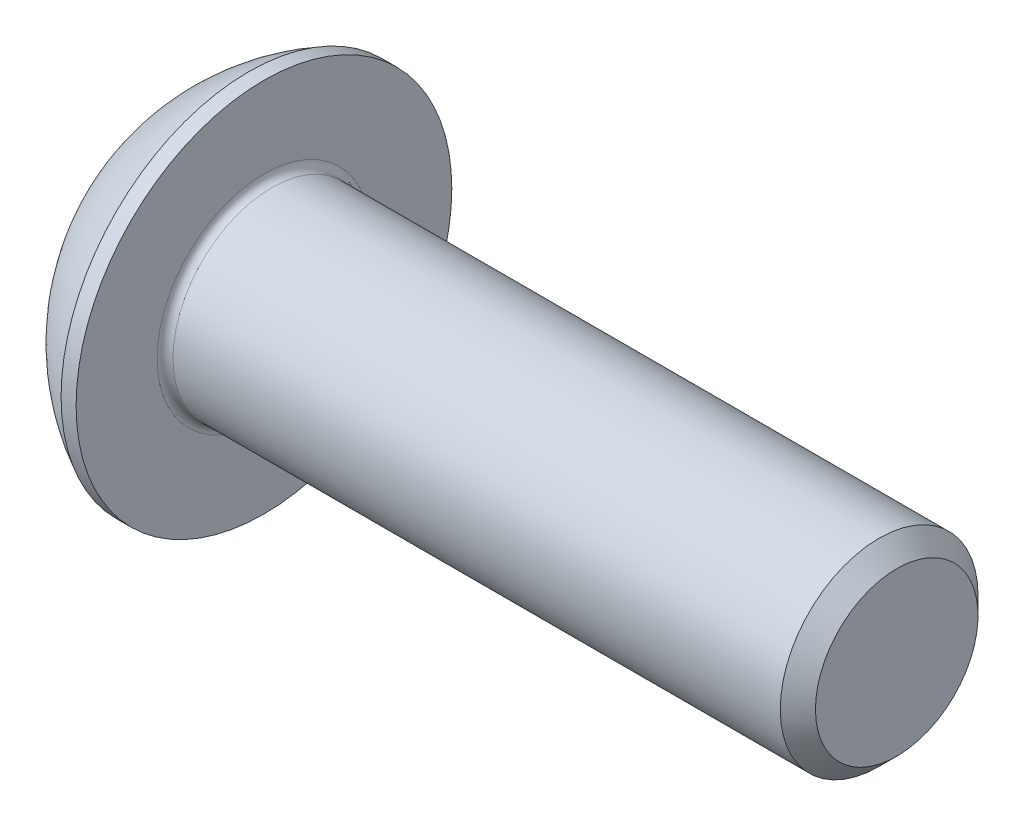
ISO-10303-21;
HEADER;
FILE_DESCRIPTION(('STEP AP214'),'2;1');
FILE_NAME('part.step','',(''),(''),'','','');
FILE_SCHEMA(('AUTOMOTIVE_DESIGN { 1 0 10303 214 1 1 1 1 }'));
ENDSEC;
DATA;
#1=APPLICATION_CONTEXT('core data for automotive mechanical design processes');
#2=APPLICATION_PROTOCOL_DEFINITION('international standard','automotive_design',2000,#1);
#3=PRODUCT_CONTEXT('',#1,'mechanical');
#4=PRODUCT('Part','Part','',(#3));
#5=PRODUCT_RELATED_PRODUCT_CATEGORY('part','',(#4));
#6=PRODUCT_DEFINITION_FORMATION('','',#4);
#7=PRODUCT_DEFINITION_CONTEXT('part definition',#1,'design');
#8=PRODUCT_DEFINITION('design','',#6,#7);
#9=PRODUCT_DEFINITION_SHAPE('','',#8);
#10=(LENGTH_UNIT() NAMED_UNIT(*) SI_UNIT(.MILLI.,.METRE.));
#11=(NAMED_UNIT(*) PLANE_ANGLE_UNIT() SI_UNIT($,.RADIAN.));
#12=(NAMED_UNIT(*) SI_UNIT($,.STERADIAN.) SOLID_ANGLE_UNIT());
#13=UNCERTAINTY_MEASURE_WITH_UNIT(LENGTH_MEASURE(1.E-05),#10,'distance_accuracy_value','');
#14=(GEOMETRIC_REPRESENTATION_CONTEXT(3) GLOBAL_UNCERTAINTY_ASSIGNED_CONTEXT((#13)) GLOBAL_UNIT_ASSIGNED_CONTEXT((#10,
#11,#12)) REPRESENTATION_CONTEXT('',''));
#15=CARTESIAN_POINT('',(0.,0.,0.));
#16=DIRECTION('',(0.,0.,1.));
#17=DIRECTION('',(1.,0.,0.));
#18=AXIS2_PLACEMENT_3D('',#15,#16,#17);
#19=CARTESIAN_POINT('',(0.,0.,0.));
#20=DIRECTION('',(-1.,0.,0.));
#21=DIRECTION('',(0.,0.,1.));
#22=AXIS2_PLACEMENT_3D('',#19,#20,#21);
#23=PLANE('',#22);
#24=CARTESIAN_POINT('',(0.,0.,0.));
#25=DIRECTION('',(-1.,0.,0.));
#26=DIRECTION('',(0.,0.,1.));
#27=AXIS2_PLACEMENT_3D('',#24,#25,#26);
#28=CIRCLE('',#27,2.375);
#29=CARTESIAN_POINT('',(0.,2.375,0.));
#30=VERTEX_POINT('',#29);
#31=EDGE_CURVE('E156',#30,#30,#28,.T.);
#32=ORIENTED_EDGE('',*,*,#31,.T.);
#33=EDGE_LOOP('',(#32));
#34=FACE_BOUND('',#33,.T.);
#35=DIRECTION('',(0.,-1.,0.));
#36=VECTOR('',#35,1.);
#37=CARTESIAN_POINT('',(0.,-0.866025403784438,1.5));
#38=LINE('',#37,#36);
#39=CARTESIAN_POINT('',(0.,0.86602540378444,1.5));
#40=VERTEX_POINT('',#39);
#41=CARTESIAN_POINT('',(0.,-0.866025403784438,1.5));
#42=VERTEX_POINT('',#41);
#43=EDGE_CURVE('E51',#40,#42,#38,.T.);
#44=ORIENTED_EDGE('',*,*,#43,.T.);
#45=DIRECTION('',(0.,-0.5,-0.866025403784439));
#46=VECTOR('',#45,1.);
#47=CARTESIAN_POINT('',(0.,-1.73205080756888,0.));
#48=LINE('',#47,#46);
#49=CARTESIAN_POINT('',(0.,-1.73205080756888,0.));
#50=VERTEX_POINT('',#49);
#51=EDGE_CURVE('E276',#42,#50,#48,.T.);
#52=ORIENTED_EDGE('',*,*,#51,.T.);
#53=DIRECTION('',(0.,0.5,-0.866025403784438));
#54=VECTOR('',#53,1.);
#55=CARTESIAN_POINT('',(0.,-0.866025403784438,-1.5));
#56=LINE('',#55,#54);
#57=CARTESIAN_POINT('',(0.,-0.866025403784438,-1.5));
#58=VERTEX_POINT('',#57);
#59=EDGE_CURVE('E131',#50,#58,#56,.T.);
#60=ORIENTED_EDGE('',*,*,#59,.T.);
#61=DIRECTION('',(0.,1.,0.));
#62=VECTOR('',#61,1.);
#63=CARTESIAN_POINT('',(0.,0.86602540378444,-1.5));
#64=LINE('',#63,#62);
#65=CARTESIAN_POINT('',(0.,0.86602540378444,-1.5));
#66=VERTEX_POINT('',#65);
#67=EDGE_CURVE('E279',#58,#66,#64,.T.);
#68=ORIENTED_EDGE('',*,*,#67,.T.);
#69=DIRECTION('',(0.,0.5,0.866025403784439));
#70=VECTOR('',#69,1.);
#71=CARTESIAN_POINT('',(0.,1.73205080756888,0.));
#72=LINE('',#71,#70);
#73=CARTESIAN_POINT('',(0.,1.73205080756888,0.));
#74=VERTEX_POINT('',#73);
#75=EDGE_CURVE('E281',#66,#74,#72,.T.);
#76=ORIENTED_EDGE('',*,*,#75,.T.);
#77=DIRECTION('',(0.,-0.5,0.866025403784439));
#78=VECTOR('',#77,1.);
#79=CARTESIAN_POINT('',(0.,0.86602540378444,1.5));
#80=LINE('',#79,#78);
#81=EDGE_CURVE('E283',#74,#40,#80,.T.);
#82=ORIENTED_EDGE('',*,*,#81,.T.);
#83=EDGE_LOOP('',(#44,#52,#60,#68,#76,#82));
#84=FACE_BOUND('',#83,.T.);
#85=ADVANCED_FACE('F36',(#34,#84),#23,.T.);
#86=CARTESIAN_POINT('',(4.75501582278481,0.,0.));
#87=DIRECTION('',(-1.,0.,0.));
#88=DIRECTION('',(0.,1.,0.));
#89=AXIS2_PLACEMENT_3D('',#86,#87,#88);
#90=SPHERICAL_SURFACE('',#89,5.3151482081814);
#91=CARTESIAN_POINT('',(2.37,0.,0.));
#92=DIRECTION('',(-1.,0.,0.));
#93=DIRECTION('',(0.,0.,1.));
#94=AXIS2_PLACEMENT_3D('',#91,#92,#93);
#95=CIRCLE('',#94,4.75);
#96=CARTESIAN_POINT('',(2.37,4.75,0.));
#97=VERTEX_POINT('',#96);
#98=EDGE_CURVE('E153',#97,#97,#95,.T.);
#99=CARTESIAN_POINT('',(2.37,4.75,0.));
#100=CARTESIAN_POINT('',(2.33822259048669,4.7340443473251,0.));
#101=CARTESIAN_POINT('',(2.30660534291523,4.71776971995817,0.));
#102=CARTESIAN_POINT('',(2.24370380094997,4.68458927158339,0.));
#103=CARTESIAN_POINT('',(2.21241950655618,4.66768345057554,0.));
#104=CARTESIAN_POINT('',(2.15019650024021,4.6332473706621,0.));
#105=CARTESIAN_POINT('',(2.11925778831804,4.6157171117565,0.));
#106=CARTESIAN_POINT('',(2.05773840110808,4.58003923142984,0.));
#107=CARTESIAN_POINT('',(2.02715772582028,4.56189161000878,0.));
#108=CARTESIAN_POINT('',(1.96636673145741,4.52498631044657,0.));
#109=CARTESIAN_POINT('',(1.93615641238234,4.50622863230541,0.));
#110=CARTESIAN_POINT('',(1.87611829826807,4.46811077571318,0.));
#111=CARTESIAN_POINT('',(1.84629050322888,4.4487505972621,0.));
#112=CARTESIAN_POINT('',(1.78702945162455,4.40943553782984,0.));
#113=CARTESIAN_POINT('',(1.75759619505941,4.38948065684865,0.));
#114=CARTESIAN_POINT('',(1.69913607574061,4.34898423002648,0.));
#115=CARTESIAN_POINT('',(1.67010921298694,4.32844268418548,0.));
#116=CARTESIAN_POINT('',(1.61247357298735,4.28678120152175,0.));
#117=CARTESIAN_POINT('',(1.58386479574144,4.265661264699,0.));
#118=CARTESIAN_POINT('',(1.52707685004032,4.22285150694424,0.));
#119=CARTESIAN_POINT('',(1.49889768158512,4.20116168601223,0.));
#120=CARTESIAN_POINT('',(1.44298030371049,4.15722089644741,0.));
#121=CARTESIAN_POINT('',(1.41524209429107,4.13496992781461,0.));
#122=CARTESIAN_POINT('',(1.36021780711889,4.08991580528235,0.));
#123=CARTESIAN_POINT('',(1.33293172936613,4.06711265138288,0.));
#124=CARTESIAN_POINT('',(1.278822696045,4.02096334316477,0.));
#125=CARTESIAN_POINT('',(1.25199974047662,3.99761718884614,0.));
#126=CARTESIAN_POINT('',(1.19882775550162,3.95039128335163,0.));
#127=CARTESIAN_POINT('',(1.172478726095,3.92651153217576,0.));
#128=CARTESIAN_POINT('',(1.1202652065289,3.87822805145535,0.));
#129=CARTESIAN_POINT('',(1.09440071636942,3.85382432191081,0.));
#130=CARTESIAN_POINT('',(1.04316669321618,3.8045027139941,0.));
#131=CARTESIAN_POINT('',(1.01779716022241,3.77958483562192,0.));
#132=CARTESIAN_POINT('',(0.9675632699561,3.72924496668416,0.));
#133=CARTESIAN_POINT('',(0.942698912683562,3.70382297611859,0.));
#134=CARTESIAN_POINT('',(0.89348538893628,3.65248512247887,0.));
#135=CARTESIAN_POINT('',(0.869136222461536,3.62656925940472,0.));
#136=CARTESIAN_POINT('',(0.82096288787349,3.57425409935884,0.));
#137=CARTESIAN_POINT('',(0.797138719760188,3.54785480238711,0.));
#138=CARTESIAN_POINT('',(0.750024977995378,3.49458340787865,0.));
#139=CARTESIAN_POINT('',(0.726735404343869,3.46771131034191,0.));
#140=CARTESIAN_POINT('',(0.680700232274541,3.41350513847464,0.));
#141=CARTESIAN_POINT('',(0.657954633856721,3.3861710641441,0.));
#142=CARTESIAN_POINT('',(0.613016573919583,3.33105194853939,0.));
#143=CARTESIAN_POINT('',(0.590824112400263,3.30326690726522,0.));
#144=CARTESIAN_POINT('',(0.547001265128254,3.24725704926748,0.));
#145=CARTESIAN_POINT('',(0.525370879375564,3.21903223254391,0.));
#146=CARTESIAN_POINT('',(0.48268089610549,3.16215419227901,0.));
#147=CARTESIAN_POINT('',(0.461621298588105,3.13350096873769,0.));
#148=CARTESIAN_POINT('',(0.420081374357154,3.07577765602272,0.));
#149=CARTESIAN_POINT('',(0.399601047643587,3.04670756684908,0.));
#150=CARTESIAN_POINT('',(0.359227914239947,2.98816223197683,0.));
#151=CARTESIAN_POINT('',(0.339335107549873,2.95868698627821,0.));
#152=CARTESIAN_POINT('',(0.300145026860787,2.89934321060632,0.));
#153=CARTESIAN_POINT('',(0.280847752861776,2.86947468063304,0.));
#154=CARTESIAN_POINT('',(0.242856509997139,2.80935636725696,0.));
#155=CARTESIAN_POINT('',(0.224162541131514,2.77910658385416,0.));
#156=CARTESIAN_POINT('',(0.187385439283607,2.71823794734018,0.));
#157=CARTESIAN_POINT('',(0.169302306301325,2.68761909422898,0.));
#158=CARTESIAN_POINT('',(0.133754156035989,2.626024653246,0.));
#159=CARTESIAN_POINT('',(0.116289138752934,2.59504906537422,0.));
#160=CARTESIAN_POINT('',(0.081984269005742,2.53275362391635,0.));
#161=CARTESIAN_POINT('',(0.0651444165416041,2.50143377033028,0.));
#162=CARTESIAN_POINT('',(0.03209660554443,2.43846244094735,0.));
#163=CARTESIAN_POINT('',(0.0158886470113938,2.40681096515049,0.));
#164=CARTESIAN_POINT('',(0.,2.375,0.));
#165=B_SPLINE_CURVE_WITH_KNOTS('',3,(#99,#100,#101,#102,#103,#104,#105,#106,#107,#108,#109,#110,
#111,#112,#113,#114,#115,#116,#117,#118,#119,#120,#121,#122,#123,#124,#125,#126,#127,#128,#129,
#130,#131,#132,#133,#134,#135,#136,#137,#138,#139,#140,#141,#142,#143,#144,#145,#146,#147,#148,
#149,#150,#151,#152,#153,#154,#155,#156,#157,#158,#159,#160,#161,#162,#163,#164),.UNSPECIFIED.,
.F.,.F.,(4,2,2,2,2,2,2,2,2,2,2,2,2,2,2,2,2,2,2,2,2,2,2,2,2,2,2,2,2,2,2,2,4),(0.,
0.106672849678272,0.213345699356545,0.320018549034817,0.426691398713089,0.533364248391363,
0.640037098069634,0.746709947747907,0.853382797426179,0.960055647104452,1.06672849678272,
1.173401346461,1.28007419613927,1.38674704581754,1.49341989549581,1.60009274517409,
1.70676559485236,1.81343844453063,1.9201112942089,2.02678414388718,2.13345699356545,
2.24012984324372,2.34680269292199,2.45347554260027,2.56014839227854,2.66682124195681,
2.77349409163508,2.88016694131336,2.98683979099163,3.0935126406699,3.20018549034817,
3.30685834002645,3.41353118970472),.UNSPECIFIED.);
#166=EDGE_CURVE('BSEAM177',#97,#30,#165,.T.);
#167=ORIENTED_EDGE('',*,*,#98,.T.);
#168=ORIENTED_EDGE('',*,*,#31,.F.);
#169=ORIENTED_EDGE('',*,*,#166,.T.);
#170=ORIENTED_EDGE('',*,*,#166,.F.);
#171=EDGE_LOOP('',(#167,#169,#168,#170));
#172=FACE_BOUND('',#171,.T.);
#173=ADVANCED_FACE('F177',(#172),#90,.T.);
#174=CARTESIAN_POINT('',(0.,0.,0.));
#175=DIRECTION('',(-1.,0.,0.));
#176=DIRECTION('',(0.,0.,1.));
#177=AXIS2_PLACEMENT_3D('',#174,#175,#176);
#178=CYLINDRICAL_SURFACE('',#177,4.75);
#179=ORIENTED_EDGE('',*,*,#98,.F.);
#180=EDGE_LOOP('',(#179));
#181=FACE_BOUND('',#180,.T.);
#182=CARTESIAN_POINT('',(2.75,0.,0.));
#183=DIRECTION('',(-1.,0.,0.));
#184=DIRECTION('',(0.,0.,1.));
#185=AXIS2_PLACEMENT_3D('',#182,#183,#184);
#186=CIRCLE('',#185,4.75);
#187=CARTESIAN_POINT('',(2.75,0.,4.75));
#188=VERTEX_POINT('',#187);
#189=EDGE_CURVE('E150',#188,#188,#186,.T.);
#190=ORIENTED_EDGE('',*,*,#189,.T.);
#191=EDGE_LOOP('',(#190));
#192=FACE_BOUND('',#191,.T.);
#193=ADVANCED_FACE('F182',(#181,#192),#178,.T.);
#194=CARTESIAN_POINT('',(2.75,2.49999999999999,0.));
#195=DIRECTION('',(-1.,0.,0.));
#196=DIRECTION('',(0.,0.,1.));
#197=AXIS2_PLACEMENT_3D('',#194,#195,#196);
#198=PLANE('',#197);
#199=CARTESIAN_POINT('',(2.75,0.,0.));
#200=DIRECTION('',(-1.,0.,0.));
#201=DIRECTION('',(0.,0.,1.));
#202=AXIS2_PLACEMENT_3D('',#199,#200,#201);
#203=CIRCLE('',#202,2.7);
#204=CARTESIAN_POINT('',(2.75,0.,2.7));
#205=VERTEX_POINT('',#204);
#206=EDGE_CURVE('E44',#205,#205,#203,.T.);
#207=ORIENTED_EDGE('',*,*,#206,.T.);
#208=EDGE_LOOP('',(#207));
#209=FACE_BOUND('',#208,.T.);
#210=ORIENTED_EDGE('',*,*,#189,.F.);
#211=EDGE_LOOP('',(#210));
#212=FACE_BOUND('',#211,.T.);
#213=ADVANCED_FACE('F161',(#209,#212),#198,.F.);
#214=CARTESIAN_POINT('',(0.,0.,0.));
#215=DIRECTION('',(-1.,0.,0.));
#216=DIRECTION('',(0.,0.,1.));
#217=AXIS2_PLACEMENT_3D('',#214,#215,#216);
#218=CYLINDRICAL_SURFACE('',#217,2.5);
#219=CARTESIAN_POINT('',(2.95,0.,0.));
#220=DIRECTION('',(-1.,0.,0.));
#221=DIRECTION('',(0.,0.,1.));
#222=AXIS2_PLACEMENT_3D('',#219,#220,#221);
#223=CIRCLE('',#222,2.5);
#224=CARTESIAN_POINT('',(2.95,0.,2.5));
#225=VERTEX_POINT('',#224);
#226=EDGE_CURVE('E11',#225,#225,#223,.F.);
#227=ORIENTED_EDGE('',*,*,#226,.T.);
#228=EDGE_LOOP('',(#227));
#229=FACE_BOUND('',#228,.T.);
#230=CARTESIAN_POINT('',(18.305,0.,0.));
#231=DIRECTION('',(-1.,0.,0.));
#232=DIRECTION('',(0.,0.,1.));
#233=AXIS2_PLACEMENT_3D('',#230,#231,#232);
#234=CIRCLE('',#233,2.5);
#235=CARTESIAN_POINT('',(18.305,0.,2.5));
#236=VERTEX_POINT('',#235);
#237=EDGE_CURVE('E147',#236,#236,#234,.T.);
#238=ORIENTED_EDGE('',*,*,#237,.T.);
#239=EDGE_LOOP('',(#238));
#240=FACE_BOUND('',#239,.T.);
#241=ADVANCED_FACE('F191',(#229,#240),#218,.T.);
#242=CARTESIAN_POINT('',(18.75,0.,0.));
#243=DIRECTION('',(-1.,0.,0.));
#244=DIRECTION('',(0.,0.,1.));
#245=AXIS2_PLACEMENT_3D('',#242,#243,#244);
#246=CONICAL_SURFACE('',#245,2.055,0.785398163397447);
#247=ORIENTED_EDGE('',*,*,#237,.F.);
#248=EDGE_LOOP('',(#247));
#249=FACE_BOUND('',#248,.T.);
#250=CARTESIAN_POINT('',(18.75,0.,0.));
#251=DIRECTION('',(-1.,0.,0.));
#252=DIRECTION('',(0.,0.,1.));
#253=AXIS2_PLACEMENT_3D('',#250,#251,#252);
#254=CIRCLE('',#253,2.055);
#255=CARTESIAN_POINT('',(18.75,0.,2.055));
#256=VERTEX_POINT('',#255);
#257=EDGE_CURVE('E143',#256,#256,#254,.T.);
#258=ORIENTED_EDGE('',*,*,#257,.T.);
#259=EDGE_LOOP('',(#258));
#260=FACE_BOUND('',#259,.T.);
#261=ADVANCED_FACE('F172',(#249,#260),#246,.T.);
#262=CARTESIAN_POINT('',(18.75,0.,0.));
#263=DIRECTION('',(-1.,0.,0.));
#264=DIRECTION('',(0.,0.,1.));
#265=AXIS2_PLACEMENT_3D('',#262,#263,#264);
#266=PLANE('',#265);
#267=ORIENTED_EDGE('',*,*,#257,.F.);
#268=EDGE_LOOP('',(#267));
#269=FACE_BOUND('',#268,.T.);
#270=ADVANCED_FACE('F165',(#269),#266,.F.);
#271=CARTESIAN_POINT('',(2.95,0.,0.));
#272=DIRECTION('',(-1.,0.,0.));
#273=DIRECTION('',(0.,0.,1.));
#274=AXIS2_PLACEMENT_3D('',#271,#272,#273);
#275=TOROIDAL_SURFACE('',#274,2.7,0.2);
#276=ORIENTED_EDGE('',*,*,#226,.F.);
#277=EDGE_LOOP('',(#276));
#278=FACE_BOUND('',#277,.T.);
#279=ORIENTED_EDGE('',*,*,#206,.F.);
#280=EDGE_LOOP('',(#279));
#281=FACE_BOUND('',#280,.T.);
#282=ADVANCED_FACE('F38',(#278,#281),#275,.F.);
#283=CARTESIAN_POINT('',(1.56,-1.73205080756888,0.));
#284=DIRECTION('',(0.,0.866025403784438,-0.5));
#285=DIRECTION('',(0.,0.5,0.866025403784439));
#286=AXIS2_PLACEMENT_3D('',#283,#284,#285);
#287=PLANE('',#286);
#288=DIRECTION('',(0.,-0.5,-0.866025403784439));
#289=VECTOR('',#288,1.);
#290=CARTESIAN_POINT('',(1.56,-1.73205080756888,0.));
#291=LINE('',#290,#289);
#292=CARTESIAN_POINT('',(1.56,-0.866025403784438,1.5));
#293=VERTEX_POINT('',#292);
#294=CARTESIAN_POINT('',(1.56,-1.29903810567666,0.75));
#295=VERTEX_POINT('',#294);
#296=EDGE_CURVE('E117',#293,#295,#291,.T.);
#297=ORIENTED_EDGE('',*,*,#296,.T.);
#298=CARTESIAN_POINT('',(1.56,-1.73205080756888,0.));
#299=VERTEX_POINT('',#298);
#300=EDGE_CURVE('E112',#295,#299,#291,.T.);
#301=ORIENTED_EDGE('',*,*,#300,.T.);
#302=DIRECTION('',(-1.,0.,0.));
#303=VECTOR('',#302,1.);
#304=CARTESIAN_POINT('',(1.56,-1.73205080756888,0.));
#305=LINE('',#304,#303);
#306=EDGE_CURVE('E114',#299,#50,#305,.T.);
#307=ORIENTED_EDGE('',*,*,#306,.T.);
#308=ORIENTED_EDGE('',*,*,#51,.F.);
#309=DIRECTION('',(-1.,0.,0.));
#310=VECTOR('',#309,1.);
#311=CARTESIAN_POINT('',(1.56,-0.866025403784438,1.5));
#312=LINE('',#311,#310);
#313=EDGE_CURVE('E272',#293,#42,#312,.T.);
#314=ORIENTED_EDGE('',*,*,#313,.F.);
#315=EDGE_LOOP('',(#297,#301,#307,#308,#314));
#316=FACE_BOUND('',#315,.T.);
#317=ADVANCED_FACE('F113',(#316),#287,.T.);
#318=CARTESIAN_POINT('',(1.56,-0.866025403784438,-1.5));
#319=DIRECTION('',(0.,0.866025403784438,0.5));
#320=DIRECTION('',(0.,-0.5,0.866025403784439));
#321=AXIS2_PLACEMENT_3D('',#318,#319,#320);
#322=PLANE('',#321);
#323=DIRECTION('',(0.,0.5,-0.866025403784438));
#324=VECTOR('',#323,1.);
#325=CARTESIAN_POINT('',(1.56,-0.866025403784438,-1.5));
#326=LINE('',#325,#324);
#327=CARTESIAN_POINT('',(1.56,-1.29903810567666,-0.75));
#328=VERTEX_POINT('',#327);
#329=EDGE_CURVE('E59',#299,#328,#326,.T.);
#330=ORIENTED_EDGE('',*,*,#329,.T.);
#331=CARTESIAN_POINT('',(1.56,-0.866025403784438,-1.5));
#332=VERTEX_POINT('',#331);
#333=EDGE_CURVE('E126',#328,#332,#326,.T.);
#334=ORIENTED_EDGE('',*,*,#333,.T.);
#335=DIRECTION('',(-1.,0.,0.));
#336=VECTOR('',#335,1.);
#337=CARTESIAN_POINT('',(1.56,-0.866025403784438,-1.5));
#338=LINE('',#337,#336);
#339=EDGE_CURVE('E133',#332,#58,#338,.T.);
#340=ORIENTED_EDGE('',*,*,#339,.T.);
#341=ORIENTED_EDGE('',*,*,#59,.F.);
#342=ORIENTED_EDGE('',*,*,#306,.F.);
#343=EDGE_LOOP('',(#330,#334,#340,#341,#342));
#344=FACE_BOUND('',#343,.T.);
#345=ADVANCED_FACE('F129',(#344),#322,.T.);
#346=CARTESIAN_POINT('',(1.56,0.86602540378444,-1.5));
#347=DIRECTION('',(0.,0.,1.));
#348=DIRECTION('',(0.,-1.,0.));
#349=AXIS2_PLACEMENT_3D('',#346,#347,#348);
#350=PLANE('',#349);
#351=DIRECTION('',(0.,1.,0.));
#352=VECTOR('',#351,1.);
#353=CARTESIAN_POINT('',(1.56,0.86602540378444,-1.5));
#354=LINE('',#353,#352);
#355=CARTESIAN_POINT('',(1.56,0.,-1.5));
#356=VERTEX_POINT('',#355);
#357=EDGE_CURVE('E253',#332,#356,#354,.T.);
#358=ORIENTED_EDGE('',*,*,#357,.T.);
#359=CARTESIAN_POINT('',(1.56,0.86602540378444,-1.5));
#360=VERTEX_POINT('',#359);
#361=EDGE_CURVE('E125',#356,#360,#354,.T.);
#362=ORIENTED_EDGE('',*,*,#361,.T.);
#363=DIRECTION('',(-1.,0.,0.));
#364=VECTOR('',#363,1.);
#365=CARTESIAN_POINT('',(1.56,0.86602540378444,-1.5));
#366=LINE('',#365,#364);
#367=EDGE_CURVE('E138',#360,#66,#366,.T.);
#368=ORIENTED_EDGE('',*,*,#367,.T.);
#369=ORIENTED_EDGE('',*,*,#67,.F.);
#370=ORIENTED_EDGE('',*,*,#339,.F.);
#371=EDGE_LOOP('',(#358,#362,#368,#369,#370));
#372=FACE_BOUND('',#371,.T.);
#373=ADVANCED_FACE('F205',(#372),#350,.T.);
#374=CARTESIAN_POINT('',(1.56,1.73205080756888,0.));
#375=DIRECTION('',(0.,-0.866025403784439,0.5));
#376=DIRECTION('',(0.,-0.5,-0.866025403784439));
#377=AXIS2_PLACEMENT_3D('',#374,#375,#376);
#378=PLANE('',#377);
#379=DIRECTION('',(0.,0.5,0.866025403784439));
#380=VECTOR('',#379,1.);
#381=CARTESIAN_POINT('',(1.56,1.73205080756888,0.));
#382=LINE('',#381,#380);
#383=CARTESIAN_POINT('',(1.56,1.29903810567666,-0.750000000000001));
#384=VERTEX_POINT('',#383);
#385=EDGE_CURVE('E242',#360,#384,#382,.T.);
#386=ORIENTED_EDGE('',*,*,#385,.T.);
#387=CARTESIAN_POINT('',(1.56,1.73205080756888,0.));
#388=VERTEX_POINT('',#387);
#389=EDGE_CURVE('E247',#384,#388,#382,.T.);
#390=ORIENTED_EDGE('',*,*,#389,.T.);
#391=DIRECTION('',(-1.,0.,0.));
#392=VECTOR('',#391,1.);
#393=CARTESIAN_POINT('',(1.56,1.73205080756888,0.));
#394=LINE('',#393,#392);
#395=EDGE_CURVE('E287',#388,#74,#394,.T.);
#396=ORIENTED_EDGE('',*,*,#395,.T.);
#397=ORIENTED_EDGE('',*,*,#75,.F.);
#398=ORIENTED_EDGE('',*,*,#367,.F.);
#399=EDGE_LOOP('',(#386,#390,#396,#397,#398));
#400=FACE_BOUND('',#399,.T.);
#401=ADVANCED_FACE('F208',(#400),#378,.T.);
#402=CARTESIAN_POINT('',(1.56,0.86602540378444,1.5));
#403=DIRECTION('',(0.,-0.866025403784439,-0.5));
#404=DIRECTION('',(0.,0.5,-0.866025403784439));
#405=AXIS2_PLACEMENT_3D('',#402,#403,#404);
#406=PLANE('',#405);
#407=DIRECTION('',(0.,-0.5,0.866025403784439));
#408=VECTOR('',#407,1.);
#409=CARTESIAN_POINT('',(1.56,0.86602540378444,1.5));
#410=LINE('',#409,#408);
#411=CARTESIAN_POINT('',(1.56,1.29903810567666,0.75));
#412=VERTEX_POINT('',#411);
#413=EDGE_CURVE('E250',#388,#412,#410,.T.);
#414=ORIENTED_EDGE('',*,*,#413,.T.);
#415=CARTESIAN_POINT('',(1.56,0.86602540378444,1.5));
#416=VERTEX_POINT('',#415);
#417=EDGE_CURVE('E258',#412,#416,#410,.T.);
#418=ORIENTED_EDGE('',*,*,#417,.T.);
#419=DIRECTION('',(-1.,0.,0.));
#420=VECTOR('',#419,1.);
#421=CARTESIAN_POINT('',(1.56,0.86602540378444,1.5));
#422=LINE('',#421,#420);
#423=EDGE_CURVE('E271',#416,#40,#422,.T.);
#424=ORIENTED_EDGE('',*,*,#423,.T.);
#425=ORIENTED_EDGE('',*,*,#81,.F.);
#426=ORIENTED_EDGE('',*,*,#395,.F.);
#427=EDGE_LOOP('',(#414,#418,#424,#425,#426));
#428=FACE_BOUND('',#427,.T.);
#429=ADVANCED_FACE('F212',(#428),#406,.T.);
#430=CARTESIAN_POINT('',(1.56,-0.866025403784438,1.5));
#431=DIRECTION('',(0.,0.,-1.));
#432=DIRECTION('',(0.,1.,0.));
#433=AXIS2_PLACEMENT_3D('',#430,#431,#432);
#434=PLANE('',#433);
#435=DIRECTION('',(0.,-1.,0.));
#436=VECTOR('',#435,1.);
#437=CARTESIAN_POINT('',(1.56,-0.866025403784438,1.5));
#438=LINE('',#437,#436);
#439=CARTESIAN_POINT('',(1.56,0.,1.5));
#440=VERTEX_POINT('',#439);
#441=EDGE_CURVE('E264',#416,#440,#438,.T.);
#442=ORIENTED_EDGE('',*,*,#441,.T.);
#443=EDGE_CURVE('E266',#440,#293,#438,.T.);
#444=ORIENTED_EDGE('',*,*,#443,.T.);
#445=ORIENTED_EDGE('',*,*,#313,.T.);
#446=ORIENTED_EDGE('',*,*,#43,.F.);
#447=ORIENTED_EDGE('',*,*,#423,.F.);
#448=EDGE_LOOP('',(#442,#444,#445,#446,#447));
#449=FACE_BOUND('',#448,.T.);
#450=ADVANCED_FACE('F216',(#449),#434,.T.);
#451=CARTESIAN_POINT('',(1.56,-1.73205080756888,0.));
#452=DIRECTION('',(1.,0.,0.));
#453=DIRECTION('',(0.,0.,-1.));
#454=AXIS2_PLACEMENT_3D('',#451,#452,#453);
#455=PLANE('',#454);
#456=CARTESIAN_POINT('',(1.56,0.,0.));
#457=DIRECTION('',(-1.,0.,0.));
#458=DIRECTION('',(0.,0.,1.));
#459=AXIS2_PLACEMENT_3D('',#456,#457,#458);
#460=CIRCLE('',#459,1.5);
#461=EDGE_CURVE('E239',#384,#356,#460,.T.);
#462=ORIENTED_EDGE('',*,*,#461,.F.);
#463=ORIENTED_EDGE('',*,*,#385,.F.);
#464=ORIENTED_EDGE('',*,*,#361,.F.);
#465=EDGE_LOOP('',(#462,#463,#464));
#466=FACE_BOUND('',#465,.T.);
#467=ADVANCED_FACE('F220',(#466),#455,.F.);
#468=EDGE_CURVE('E144',#412,#384,#460,.T.);
#469=ORIENTED_EDGE('',*,*,#468,.F.);
#470=ORIENTED_EDGE('',*,*,#413,.F.);
#471=ORIENTED_EDGE('',*,*,#389,.F.);
#472=EDGE_LOOP('',(#469,#470,#471));
#473=FACE_BOUND('',#472,.T.);
#474=ADVANCED_FACE('F229',(#473),#455,.F.);
#475=EDGE_CURVE('E137',#440,#412,#460,.T.);
#476=ORIENTED_EDGE('',*,*,#475,.F.);
#477=ORIENTED_EDGE('',*,*,#441,.F.);
#478=ORIENTED_EDGE('',*,*,#417,.F.);
#479=EDGE_LOOP('',(#476,#477,#478));
#480=FACE_BOUND('',#479,.T.);
#481=ADVANCED_FACE('F234',(#480),#455,.F.);
#482=EDGE_CURVE('E132',#295,#440,#460,.T.);
#483=ORIENTED_EDGE('',*,*,#482,.F.);
#484=ORIENTED_EDGE('',*,*,#296,.F.);
#485=ORIENTED_EDGE('',*,*,#443,.F.);
#486=EDGE_LOOP('',(#483,#484,#485));
#487=FACE_BOUND('',#486,.T.);
#488=ADVANCED_FACE('F227',(#487),#455,.F.);
#489=EDGE_CURVE('E123',#328,#295,#460,.T.);
#490=ORIENTED_EDGE('',*,*,#489,.F.);
#491=ORIENTED_EDGE('',*,*,#329,.F.);
#492=ORIENTED_EDGE('',*,*,#300,.F.);
#493=EDGE_LOOP('',(#490,#491,#492));
#494=FACE_BOUND('',#493,.T.);
#495=ADVANCED_FACE('F122',(#494),#455,.F.);
#496=EDGE_CURVE('E245',#356,#328,#460,.T.);
#497=ORIENTED_EDGE('',*,*,#496,.F.);
#498=ORIENTED_EDGE('',*,*,#357,.F.);
#499=ORIENTED_EDGE('',*,*,#333,.F.);
#500=EDGE_LOOP('',(#497,#498,#499));
#501=FACE_BOUND('',#500,.T.);
#502=ADVANCED_FACE('F200',(#501),#455,.F.);
#503=CARTESIAN_POINT('',(2.42602540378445,0.,0.));
#504=DIRECTION('',(-1.,0.,0.));
#505=DIRECTION('',(0.,0.,1.));
#506=AXIS2_PLACEMENT_3D('',#503,#504,#505);
#507=CONICAL_SURFACE('',#506,0.,1.04719755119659);
#508=ORIENTED_EDGE('',*,*,#475,.T.);
#509=ORIENTED_EDGE('',*,*,#468,.T.);
#510=ORIENTED_EDGE('',*,*,#461,.T.);
#511=ORIENTED_EDGE('',*,*,#496,.T.);
#512=ORIENTED_EDGE('',*,*,#489,.T.);
#513=ORIENTED_EDGE('',*,*,#482,.T.);
#514=EDGE_LOOP('',(#508,#509,#510,#511,#512,#513));
#515=FACE_BOUND('',#514,.T.);
#516=CARTESIAN_POINT('',(2.42602540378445,0.,0.));
#517=VERTEX_POINT('',#516);
#518=VERTEX_LOOP('',#517);
#519=FACE_BOUND('',#518,.T.);
#520=ADVANCED_FACE('F198',(#515,#519),#507,.F.);
#521=CLOSED_SHELL('',(#85,#173,#193,#213,#241,#261,#270,#282,#317,#345,#373,#401,#429,#450,#467,
#474,#481,#488,#495,#502,#520));
#522=MANIFOLD_SOLID_BREP('B2',#521);
#523=ADVANCED_BREP_SHAPE_REPRESENTATION('',(#18,#522),#14);
#524=SHAPE_DEFINITION_REPRESENTATION(#9,#523);
ENDSEC;
END-ISO-10303-21;
